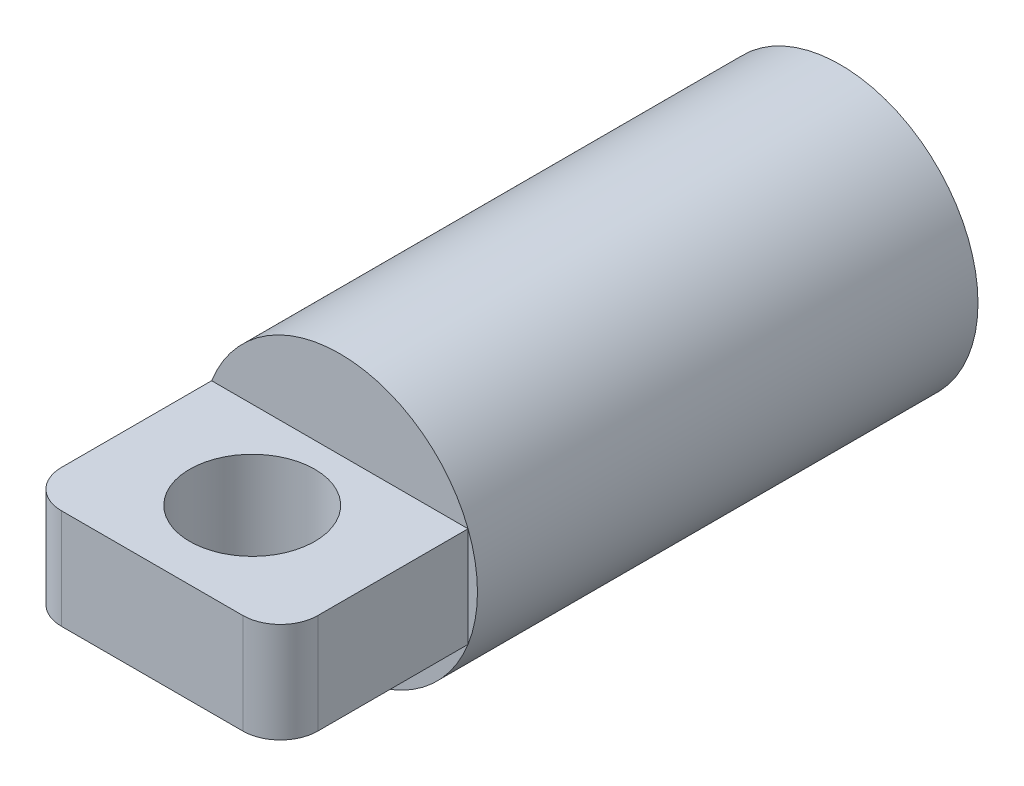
ISO-10303-21;
HEADER;
FILE_DESCRIPTION(('STEP AP214'),'2;1');
FILE_NAME('part.step','',(''),(''),'','','');
FILE_SCHEMA(('AUTOMOTIVE_DESIGN { 1 0 10303 214 1 1 1 1 }'));
ENDSEC;
DATA;
#1=APPLICATION_CONTEXT('core data for automotive mechanical design processes');
#2=APPLICATION_PROTOCOL_DEFINITION('international standard','automotive_design',2000,#1);
#3=PRODUCT_CONTEXT('',#1,'mechanical');
#4=PRODUCT('Part','Part','',(#3));
#5=PRODUCT_RELATED_PRODUCT_CATEGORY('part','',(#4));
#6=PRODUCT_DEFINITION_FORMATION('','',#4);
#7=PRODUCT_DEFINITION_CONTEXT('part definition',#1,'design');
#8=PRODUCT_DEFINITION('design','',#6,#7);
#9=PRODUCT_DEFINITION_SHAPE('','',#8);
#10=(LENGTH_UNIT() NAMED_UNIT(*) SI_UNIT(.MILLI.,.METRE.));
#11=(NAMED_UNIT(*) PLANE_ANGLE_UNIT() SI_UNIT($,.RADIAN.));
#12=(NAMED_UNIT(*) SI_UNIT($,.STERADIAN.) SOLID_ANGLE_UNIT());
#13=UNCERTAINTY_MEASURE_WITH_UNIT(LENGTH_MEASURE(1.E-05),#10,'distance_accuracy_value','');
#14=(GEOMETRIC_REPRESENTATION_CONTEXT(3) GLOBAL_UNCERTAINTY_ASSIGNED_CONTEXT((#13)) GLOBAL_UNIT_ASSIGNED_CONTEXT((#10,
#11,#12)) REPRESENTATION_CONTEXT('',''));
#15=CARTESIAN_POINT('',(0.,0.,0.));
#16=DIRECTION('',(0.,0.,1.));
#17=DIRECTION('',(1.,0.,0.));
#18=AXIS2_PLACEMENT_3D('',#15,#16,#17);
#19=CARTESIAN_POINT('',(0.,0.,55.));
#20=DIRECTION('',(0.,0.,-1.));
#21=DIRECTION('',(-1.,0.,0.));
#22=AXIS2_PLACEMENT_3D('',#19,#20,#21);
#23=CYLINDRICAL_SURFACE('',#22,11.);
#24=CARTESIAN_POINT('',(0.,0.,0.));
#25=DIRECTION('',(0.,0.,1.));
#26=DIRECTION('',(1.,0.,0.));
#27=AXIS2_PLACEMENT_3D('',#24,#25,#26);
#28=CIRCLE('',#27,11.);
#29=CARTESIAN_POINT('',(11.,0.,0.));
#30=VERTEX_POINT('',#29);
#31=EDGE_CURVE('E129',#30,#30,#28,.T.);
#32=ORIENTED_EDGE('',*,*,#31,.T.);
#33=EDGE_LOOP('',(#32));
#34=FACE_BOUND('',#33,.T.);
#35=CARTESIAN_POINT('',(0.,0.,40.));
#36=DIRECTION('',(0.,0.,1.));
#37=DIRECTION('',(1.,0.,0.));
#38=AXIS2_PLACEMENT_3D('',#35,#36,#37);
#39=CIRCLE('',#38,11.);
#40=CARTESIAN_POINT('',(10.2469507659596,4.,40.));
#41=VERTEX_POINT('',#40);
#42=CARTESIAN_POINT('',(-10.2469507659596,4.,40.));
#43=VERTEX_POINT('',#42);
#44=EDGE_CURVE('E97',#41,#43,#39,.T.);
#45=ORIENTED_EDGE('',*,*,#44,.F.);
#46=CARTESIAN_POINT('',(10.2469507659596,-4.,40.));
#47=VERTEX_POINT('',#46);
#48=EDGE_CURVE('E89',#47,#41,#39,.T.);
#49=ORIENTED_EDGE('',*,*,#48,.F.);
#50=CARTESIAN_POINT('',(-10.2469507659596,-4.,40.));
#51=VERTEX_POINT('',#50);
#52=EDGE_CURVE('E98',#51,#47,#39,.T.);
#53=ORIENTED_EDGE('',*,*,#52,.F.);
#54=EDGE_CURVE('E123',#43,#51,#39,.T.);
#55=ORIENTED_EDGE('',*,*,#54,.F.);
#56=EDGE_LOOP('',(#45,#49,#53,#55));
#57=FACE_BOUND('',#56,.T.);
#58=ADVANCED_FACE('F34',(#34,#57),#23,.T.);
#59=CARTESIAN_POINT('',(0.,0.,0.));
#60=DIRECTION('',(0.,0.,1.));
#61=DIRECTION('',(1.,0.,0.));
#62=AXIS2_PLACEMENT_3D('',#59,#60,#61);
#63=PLANE('',#62);
#64=ORIENTED_EDGE('',*,*,#31,.F.);
#65=EDGE_LOOP('',(#64));
#66=FACE_BOUND('',#65,.T.);
#67=ADVANCED_FACE('F197',(#66),#63,.F.);
#68=CARTESIAN_POINT('',(0.,0.,40.));
#69=DIRECTION('',(0.,0.,1.));
#70=DIRECTION('',(1.,0.,0.));
#71=AXIS2_PLACEMENT_3D('',#68,#69,#70);
#72=PLANE('',#71);
#73=ORIENTED_EDGE('',*,*,#44,.T.);
#74=DIRECTION('',(-1.,0.,0.));
#75=VECTOR('',#74,1.);
#76=CARTESIAN_POINT('',(-10.2469507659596,4.,40.));
#77=LINE('',#76,#75);
#78=EDGE_CURVE('E107',#41,#43,#77,.T.);
#79=ORIENTED_EDGE('',*,*,#78,.F.);
#80=EDGE_LOOP('',(#73,#79));
#81=FACE_BOUND('',#80,.T.);
#82=ADVANCED_FACE('F114',(#81),#72,.T.);
#83=ORIENTED_EDGE('',*,*,#54,.T.);
#84=DIRECTION('',(0.,-1.,0.));
#85=VECTOR('',#84,1.);
#86=CARTESIAN_POINT('',(-10.2469507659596,-4.,40.));
#87=LINE('',#86,#85);
#88=EDGE_CURVE('E116',#43,#51,#87,.T.);
#89=ORIENTED_EDGE('',*,*,#88,.F.);
#90=EDGE_LOOP('',(#83,#89));
#91=FACE_BOUND('',#90,.T.);
#92=ADVANCED_FACE('F188',(#91),#72,.T.);
#93=ORIENTED_EDGE('',*,*,#52,.T.);
#94=DIRECTION('',(1.,0.,0.));
#95=VECTOR('',#94,1.);
#96=CARTESIAN_POINT('',(-10.2469507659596,-4.,40.));
#97=LINE('',#96,#95);
#98=EDGE_CURVE('E111',#51,#47,#97,.T.);
#99=ORIENTED_EDGE('',*,*,#98,.F.);
#100=EDGE_LOOP('',(#93,#99));
#101=FACE_BOUND('',#100,.T.);
#102=ADVANCED_FACE('F186',(#101),#72,.T.);
#103=ORIENTED_EDGE('',*,*,#48,.T.);
#104=DIRECTION('',(0.,1.,0.));
#105=VECTOR('',#104,1.);
#106=CARTESIAN_POINT('',(10.2469507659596,-4.,40.));
#107=LINE('',#106,#105);
#108=EDGE_CURVE('E93',#47,#41,#107,.T.);
#109=ORIENTED_EDGE('',*,*,#108,.F.);
#110=EDGE_LOOP('',(#103,#109));
#111=FACE_BOUND('',#110,.T.);
#112=ADVANCED_FACE('F91',(#111),#72,.T.);
#113=CARTESIAN_POINT('',(10.2469507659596,-4.,40.));
#114=DIRECTION('',(1.,0.,0.));
#115=DIRECTION('',(0.,0.,-1.));
#116=AXIS2_PLACEMENT_3D('',#113,#114,#115);
#117=PLANE('',#116);
#118=DIRECTION('',(0.,0.,1.));
#119=VECTOR('',#118,1.);
#120=CARTESIAN_POINT('',(10.2469507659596,4.,40.));
#121=LINE('',#120,#119);
#122=CARTESIAN_POINT('',(10.2469507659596,4.,52.));
#123=VERTEX_POINT('',#122);
#124=EDGE_CURVE('E102',#41,#123,#121,.T.);
#125=ORIENTED_EDGE('',*,*,#124,.T.);
#126=DIRECTION('',(0.,1.,0.));
#127=VECTOR('',#126,1.);
#128=CARTESIAN_POINT('',(10.2469507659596,-4.,52.));
#129=LINE('',#128,#127);
#130=CARTESIAN_POINT('',(10.2469507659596,-4.,52.));
#131=VERTEX_POINT('',#130);
#132=EDGE_CURVE('E57',#123,#131,#129,.F.);
#133=ORIENTED_EDGE('',*,*,#132,.T.);
#134=DIRECTION('',(0.,0.,1.));
#135=VECTOR('',#134,1.);
#136=CARTESIAN_POINT('',(10.2469507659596,-4.,40.));
#137=LINE('',#136,#135);
#138=EDGE_CURVE('E119',#47,#131,#137,.T.);
#139=ORIENTED_EDGE('',*,*,#138,.F.);
#140=ORIENTED_EDGE('',*,*,#108,.T.);
#141=EDGE_LOOP('',(#125,#133,#139,#140));
#142=FACE_BOUND('',#141,.T.);
#143=ADVANCED_FACE('F118',(#142),#117,.T.);
#144=CARTESIAN_POINT('',(-10.2469507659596,-4.,40.));
#145=DIRECTION('',(0.,-1.,0.));
#146=DIRECTION('',(0.,0.,-1.));
#147=AXIS2_PLACEMENT_3D('',#144,#145,#146);
#148=PLANE('',#147);
#149=CARTESIAN_POINT('',(0.,-4.,47.));
#150=DIRECTION('',(0.,-1.,0.));
#151=DIRECTION('',(0.,0.,-1.));
#152=AXIS2_PLACEMENT_3D('',#149,#150,#151);
#153=CIRCLE('',#152,5.);
#154=CARTESIAN_POINT('',(0.,-4.,42.));
#155=VERTEX_POINT('',#154);
#156=EDGE_CURVE('E148',#155,#155,#153,.T.);
#157=ORIENTED_EDGE('',*,*,#156,.F.);
#158=EDGE_LOOP('',(#157));
#159=FACE_BOUND('',#158,.T.);
#160=ORIENTED_EDGE('',*,*,#138,.T.);
#161=CARTESIAN_POINT('',(7.2469507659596,-4.,52.));
#162=DIRECTION('',(0.,-1.,0.));
#163=DIRECTION('',(0.,0.,-1.));
#164=AXIS2_PLACEMENT_3D('',#161,#162,#163);
#165=CIRCLE('',#164,3.);
#166=CARTESIAN_POINT('',(7.2469507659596,-4.,55.));
#167=VERTEX_POINT('',#166);
#168=EDGE_CURVE('E42',#131,#167,#165,.T.);
#169=ORIENTED_EDGE('',*,*,#168,.T.);
#170=DIRECTION('',(1.,0.,0.));
#171=VECTOR('',#170,1.);
#172=CARTESIAN_POINT('',(-10.2469507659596,-4.,55.));
#173=LINE('',#172,#171);
#174=CARTESIAN_POINT('',(-7.2469507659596,-4.,55.));
#175=VERTEX_POINT('',#174);
#176=EDGE_CURVE('E121',#175,#167,#173,.T.);
#177=ORIENTED_EDGE('',*,*,#176,.F.);
#178=CARTESIAN_POINT('',(-7.2469507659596,-4.,52.));
#179=DIRECTION('',(0.,-1.,0.));
#180=DIRECTION('',(0.,0.,-1.));
#181=AXIS2_PLACEMENT_3D('',#178,#179,#180);
#182=CIRCLE('',#181,3.);
#183=CARTESIAN_POINT('',(-10.2469507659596,-4.,52.));
#184=VERTEX_POINT('',#183);
#185=EDGE_CURVE('E49',#175,#184,#182,.T.);
#186=ORIENTED_EDGE('',*,*,#185,.T.);
#187=DIRECTION('',(0.,0.,1.));
#188=VECTOR('',#187,1.);
#189=CARTESIAN_POINT('',(-10.2469507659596,-4.,40.));
#190=LINE('',#189,#188);
#191=EDGE_CURVE('E134',#51,#184,#190,.T.);
#192=ORIENTED_EDGE('',*,*,#191,.F.);
#193=ORIENTED_EDGE('',*,*,#98,.T.);
#194=EDGE_LOOP('',(#160,#169,#177,#186,#192,#193));
#195=FACE_BOUND('',#194,.T.);
#196=ADVANCED_FACE('F161',(#159,#195),#148,.T.);
#197=CARTESIAN_POINT('',(-10.2469507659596,-4.,40.));
#198=DIRECTION('',(-1.,0.,0.));
#199=DIRECTION('',(0.,0.,1.));
#200=AXIS2_PLACEMENT_3D('',#197,#198,#199);
#201=PLANE('',#200);
#202=ORIENTED_EDGE('',*,*,#191,.T.);
#203=DIRECTION('',(0.,-1.,0.));
#204=VECTOR('',#203,1.);
#205=CARTESIAN_POINT('',(-10.2469507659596,-4.,52.));
#206=LINE('',#205,#204);
#207=CARTESIAN_POINT('',(-10.2469507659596,4.,52.));
#208=VERTEX_POINT('',#207);
#209=EDGE_CURVE('E12',#184,#208,#206,.F.);
#210=ORIENTED_EDGE('',*,*,#209,.T.);
#211=DIRECTION('',(0.,0.,1.));
#212=VECTOR('',#211,1.);
#213=CARTESIAN_POINT('',(-10.2469507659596,4.,40.));
#214=LINE('',#213,#212);
#215=EDGE_CURVE('E110',#43,#208,#214,.T.);
#216=ORIENTED_EDGE('',*,*,#215,.F.);
#217=ORIENTED_EDGE('',*,*,#88,.T.);
#218=EDGE_LOOP('',(#202,#210,#216,#217));
#219=FACE_BOUND('',#218,.T.);
#220=ADVANCED_FACE('F163',(#219),#201,.T.);
#221=CARTESIAN_POINT('',(-10.2469507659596,4.,40.));
#222=DIRECTION('',(0.,1.,0.));
#223=DIRECTION('',(0.,0.,1.));
#224=AXIS2_PLACEMENT_3D('',#221,#222,#223);
#225=PLANE('',#224);
#226=CARTESIAN_POINT('',(0.,4.,47.));
#227=DIRECTION('',(0.,-1.,0.));
#228=DIRECTION('',(0.,0.,-1.));
#229=AXIS2_PLACEMENT_3D('',#226,#227,#228);
#230=CIRCLE('',#229,5.);
#231=CARTESIAN_POINT('',(0.,4.,42.));
#232=VERTEX_POINT('',#231);
#233=EDGE_CURVE('E144',#232,#232,#230,.T.);
#234=ORIENTED_EDGE('',*,*,#233,.T.);
#235=EDGE_LOOP('',(#234));
#236=FACE_BOUND('',#235,.T.);
#237=DIRECTION('',(-1.,0.,0.));
#238=VECTOR('',#237,1.);
#239=CARTESIAN_POINT('',(-10.2469507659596,4.,55.));
#240=LINE('',#239,#238);
#241=CARTESIAN_POINT('',(7.2469507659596,4.,55.));
#242=VERTEX_POINT('',#241);
#243=CARTESIAN_POINT('',(-7.2469507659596,4.,55.));
#244=VERTEX_POINT('',#243);
#245=EDGE_CURVE('E141',#242,#244,#240,.T.);
#246=ORIENTED_EDGE('',*,*,#245,.F.);
#247=CARTESIAN_POINT('',(7.2469507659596,4.,52.));
#248=DIRECTION('',(0.,1.,0.));
#249=DIRECTION('',(0.,0.,1.));
#250=AXIS2_PLACEMENT_3D('',#247,#248,#249);
#251=CIRCLE('',#250,3.);
#252=EDGE_CURVE('E109',#242,#123,#251,.T.);
#253=ORIENTED_EDGE('',*,*,#252,.T.);
#254=ORIENTED_EDGE('',*,*,#124,.F.);
#255=ORIENTED_EDGE('',*,*,#78,.T.);
#256=ORIENTED_EDGE('',*,*,#215,.T.);
#257=CARTESIAN_POINT('',(-7.2469507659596,4.,52.));
#258=DIRECTION('',(0.,1.,0.));
#259=DIRECTION('',(0.,0.,1.));
#260=AXIS2_PLACEMENT_3D('',#257,#258,#259);
#261=CIRCLE('',#260,3.);
#262=EDGE_CURVE('E175',#208,#244,#261,.T.);
#263=ORIENTED_EDGE('',*,*,#262,.T.);
#264=EDGE_LOOP('',(#246,#253,#254,#255,#256,#263));
#265=FACE_BOUND('',#264,.T.);
#266=ADVANCED_FACE('F105',(#236,#265),#225,.T.);
#267=CARTESIAN_POINT('',(0.,0.,55.));
#268=DIRECTION('',(0.,0.,1.));
#269=DIRECTION('',(1.,0.,0.));
#270=AXIS2_PLACEMENT_3D('',#267,#268,#269);
#271=PLANE('',#270);
#272=ORIENTED_EDGE('',*,*,#176,.T.);
#273=DIRECTION('',(0.,1.,0.));
#274=VECTOR('',#273,1.);
#275=CARTESIAN_POINT('',(7.2469507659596,0.,55.));
#276=LINE('',#275,#274);
#277=EDGE_CURVE('E126',#167,#242,#276,.T.);
#278=ORIENTED_EDGE('',*,*,#277,.T.);
#279=ORIENTED_EDGE('',*,*,#245,.T.);
#280=DIRECTION('',(0.,-1.,0.));
#281=VECTOR('',#280,1.);
#282=CARTESIAN_POINT('',(-7.2469507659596,0.,55.));
#283=LINE('',#282,#281);
#284=EDGE_CURVE('E124',#244,#175,#283,.T.);
#285=ORIENTED_EDGE('',*,*,#284,.T.);
#286=EDGE_LOOP('',(#272,#278,#279,#285));
#287=FACE_BOUND('',#286,.T.);
#288=ADVANCED_FACE('F178',(#287),#271,.T.);
#289=CARTESIAN_POINT('',(7.2469507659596,0.,52.));
#290=DIRECTION('',(0.,1.,0.));
#291=DIRECTION('',(0.,0.,1.));
#292=AXIS2_PLACEMENT_3D('',#289,#290,#291);
#293=CYLINDRICAL_SURFACE('',#292,3.);
#294=ORIENTED_EDGE('',*,*,#168,.F.);
#295=ORIENTED_EDGE('',*,*,#132,.F.);
#296=ORIENTED_EDGE('',*,*,#252,.F.);
#297=ORIENTED_EDGE('',*,*,#277,.F.);
#298=EDGE_LOOP('',(#294,#295,#296,#297));
#299=FACE_BOUND('',#298,.T.);
#300=ADVANCED_FACE('F169',(#299),#293,.T.);
#301=CARTESIAN_POINT('',(-7.2469507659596,0.,52.));
#302=DIRECTION('',(0.,-1.,0.));
#303=DIRECTION('',(0.,0.,-1.));
#304=AXIS2_PLACEMENT_3D('',#301,#302,#303);
#305=CYLINDRICAL_SURFACE('',#304,3.);
#306=ORIENTED_EDGE('',*,*,#262,.F.);
#307=ORIENTED_EDGE('',*,*,#209,.F.);
#308=ORIENTED_EDGE('',*,*,#185,.F.);
#309=ORIENTED_EDGE('',*,*,#284,.F.);
#310=EDGE_LOOP('',(#306,#307,#308,#309));
#311=FACE_BOUND('',#310,.T.);
#312=ADVANCED_FACE('F36',(#311),#305,.T.);
#313=CARTESIAN_POINT('',(0.,4.,47.));
#314=DIRECTION('',(0.,-1.,0.));
#315=DIRECTION('',(0.,0.,-1.));
#316=AXIS2_PLACEMENT_3D('',#313,#314,#315);
#317=CYLINDRICAL_SURFACE('',#316,5.);
#318=ORIENTED_EDGE('',*,*,#233,.F.);
#319=EDGE_LOOP('',(#318));
#320=FACE_BOUND('',#319,.T.);
#321=ORIENTED_EDGE('',*,*,#156,.T.);
#322=EDGE_LOOP('',(#321));
#323=FACE_BOUND('',#322,.T.);
#324=ADVANCED_FACE('F155',(#320,#323),#317,.F.);
#325=CLOSED_SHELL('',(#58,#67,#82,#92,#102,#112,#143,#196,#220,#266,#288,#300,#312,#324));
#326=MANIFOLD_SOLID_BREP('B2',#325);
#327=ADVANCED_BREP_SHAPE_REPRESENTATION('',(#18,#326),#14);
#328=SHAPE_DEFINITION_REPRESENTATION(#9,#327);
ENDSEC;
END-ISO-10303-21;
